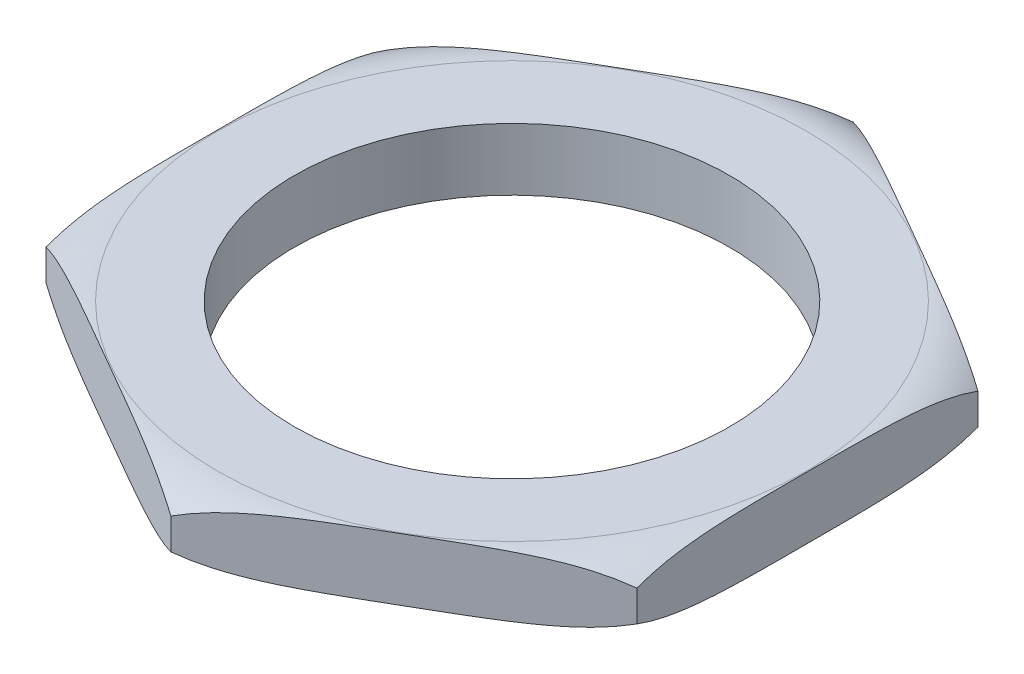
from build123d import *

# Parameters (mm, degrees)
CROQUIS1_R              = 14
SALIENTE_EXTRUIR1_DEPTH = 4


with BuildPart() as part:
    # Croquis1 → Saliente-Extruir1 (new body)
    with BuildSketch(Plane(origin=(0, 0, 0), x_dir=(1, 0, 0), z_dir=(0, 1, 0))):
        Polygon((0, 21.939310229), (-19, 10.969655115), (-19, -10.969655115), (0, -21.939310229), (19, -10.969655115), (19, 10.969655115), align=None)
        with Locations(Location((0, 0, 0), (0, 0, 270))):
            Circle(CROQUIS1_R, mode=Mode.SUBTRACT)
    extrude(amount=SALIENTE_EXTRUIR1_DEPTH)

    # Croquis2 → Cortar-Revoluci_n1 (revolve, cut)
    with BuildSketch(Plane(origin=(0, 0, 0), x_dir=(0, 0, -1), z_dir=(1, 0, 0))):
        with BuildLine():
            Line((-21.939310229, 4), (-21.939310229, 3))
            ThreePointArc((-21.939310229, 3), (-20.520449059, 3.74341649), (-18.939310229, 4))
            Line((-18.939310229, 4), (-21.939310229, 4))
        make_face()
        with BuildLine():
            Line((-18.939310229, 0), (-21.939310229, 0))
            Line((-21.939310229, 0), (-21.939310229, 1))
            ThreePointArc((-21.939310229, 1), (-20.520449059, 0.25658351), (-18.939310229, 0))
        make_face()
    revolve(axis=Axis((0, 4, 0), (0, -1, 0)), mode=Mode.SUBTRACT)


solid = part.part
